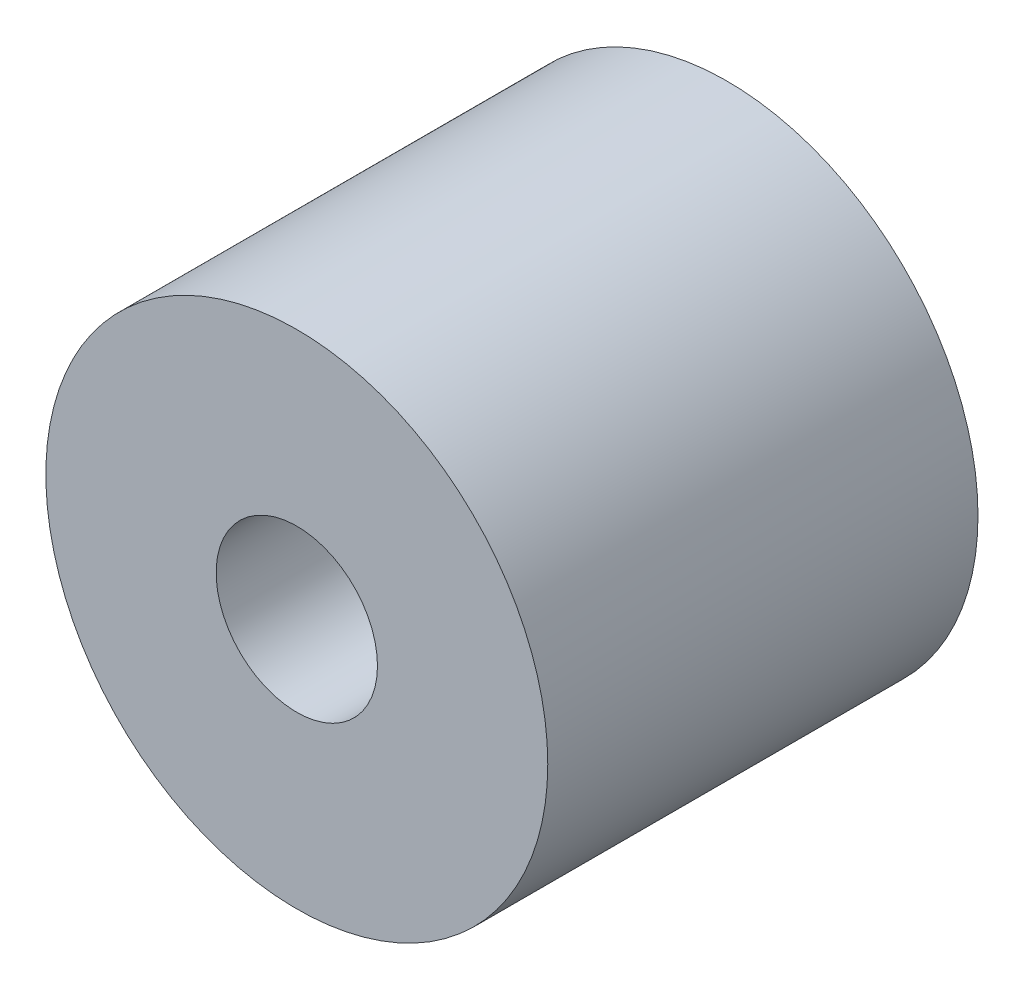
ISO-10303-21;
HEADER;
FILE_DESCRIPTION(('STEP AP214'),'2;1');
FILE_NAME('part.step','',(''),(''),'','','');
FILE_SCHEMA(('AUTOMOTIVE_DESIGN { 1 0 10303 214 1 1 1 1 }'));
ENDSEC;
DATA;
#1=APPLICATION_CONTEXT('core data for automotive mechanical design processes');
#2=APPLICATION_PROTOCOL_DEFINITION('international standard','automotive_design',2000,#1);
#3=PRODUCT_CONTEXT('',#1,'mechanical');
#4=PRODUCT('Part','Part','',(#3));
#5=PRODUCT_RELATED_PRODUCT_CATEGORY('part','',(#4));
#6=PRODUCT_DEFINITION_FORMATION('','',#4);
#7=PRODUCT_DEFINITION_CONTEXT('part definition',#1,'design');
#8=PRODUCT_DEFINITION('design','',#6,#7);
#9=PRODUCT_DEFINITION_SHAPE('','',#8);
#10=(LENGTH_UNIT() NAMED_UNIT(*) SI_UNIT(.MILLI.,.METRE.));
#11=(NAMED_UNIT(*) PLANE_ANGLE_UNIT() SI_UNIT($,.RADIAN.));
#12=(NAMED_UNIT(*) SI_UNIT($,.STERADIAN.) SOLID_ANGLE_UNIT());
#13=UNCERTAINTY_MEASURE_WITH_UNIT(LENGTH_MEASURE(1.E-05),#10,'distance_accuracy_value','');
#14=(GEOMETRIC_REPRESENTATION_CONTEXT(3) GLOBAL_UNCERTAINTY_ASSIGNED_CONTEXT((#13)) GLOBAL_UNIT_ASSIGNED_CONTEXT((#10,
#11,#12)) REPRESENTATION_CONTEXT('',''));
#15=CARTESIAN_POINT('',(0.,0.,0.));
#16=DIRECTION('',(0.,0.,1.));
#17=DIRECTION('',(1.,0.,0.));
#18=AXIS2_PLACEMENT_3D('',#15,#16,#17);
#19=CARTESIAN_POINT('',(0.,0.,12.));
#20=DIRECTION('',(0.,0.,1.));
#21=DIRECTION('',(1.,0.,0.));
#22=AXIS2_PLACEMENT_3D('',#19,#20,#21);
#23=PLANE('',#22);
#24=CARTESIAN_POINT('',(0.,0.,12.));
#25=DIRECTION('',(0.,0.,1.));
#26=DIRECTION('',(1.,0.,0.));
#27=AXIS2_PLACEMENT_3D('',#24,#25,#26);
#28=CIRCLE('',#27,7.);
#29=CARTESIAN_POINT('',(7.,0.,12.));
#30=VERTEX_POINT('',#29);
#31=EDGE_CURVE('E10',#30,#30,#28,.T.);
#32=ORIENTED_EDGE('',*,*,#31,.T.);
#33=EDGE_LOOP('',(#32));
#34=FACE_BOUND('',#33,.T.);
#35=CARTESIAN_POINT('',(0.,0.,12.));
#36=DIRECTION('',(0.,0.,1.));
#37=DIRECTION('',(1.,0.,0.));
#38=AXIS2_PLACEMENT_3D('',#35,#36,#37);
#39=CIRCLE('',#38,2.25);
#40=CARTESIAN_POINT('',(2.25,0.,12.));
#41=VERTEX_POINT('',#40);
#42=EDGE_CURVE('E42',#41,#41,#39,.T.);
#43=ORIENTED_EDGE('',*,*,#42,.F.);
#44=EDGE_LOOP('',(#43));
#45=FACE_BOUND('',#44,.T.);
#46=ADVANCED_FACE('F31',(#34,#45),#23,.T.);
#47=CARTESIAN_POINT('',(0.,0.,0.));
#48=DIRECTION('',(0.,0.,1.));
#49=DIRECTION('',(1.,0.,0.));
#50=AXIS2_PLACEMENT_3D('',#47,#48,#49);
#51=PLANE('',#50);
#52=CARTESIAN_POINT('',(0.,0.,0.));
#53=DIRECTION('',(0.,0.,1.));
#54=DIRECTION('',(1.,0.,0.));
#55=AXIS2_PLACEMENT_3D('',#52,#53,#54);
#56=CIRCLE('',#55,7.);
#57=CARTESIAN_POINT('',(7.,0.,0.));
#58=VERTEX_POINT('',#57);
#59=EDGE_CURVE('E35',#58,#58,#56,.T.);
#60=ORIENTED_EDGE('',*,*,#59,.F.);
#61=EDGE_LOOP('',(#60));
#62=FACE_BOUND('',#61,.T.);
#63=CARTESIAN_POINT('',(0.,0.,0.));
#64=DIRECTION('',(0.,0.,1.));
#65=DIRECTION('',(1.,0.,0.));
#66=AXIS2_PLACEMENT_3D('',#63,#64,#65);
#67=CIRCLE('',#66,2.25);
#68=CARTESIAN_POINT('',(2.25,0.,0.));
#69=VERTEX_POINT('',#68);
#70=EDGE_CURVE('E44',#69,#69,#67,.T.);
#71=ORIENTED_EDGE('',*,*,#70,.T.);
#72=EDGE_LOOP('',(#71));
#73=FACE_BOUND('',#72,.T.);
#74=ADVANCED_FACE('F54',(#62,#73),#51,.F.);
#75=CARTESIAN_POINT('',(0.,0.,12.));
#76=DIRECTION('',(0.,0.,-1.));
#77=DIRECTION('',(-1.,0.,0.));
#78=AXIS2_PLACEMENT_3D('',#75,#76,#77);
#79=CYLINDRICAL_SURFACE('',#78,7.);
#80=ORIENTED_EDGE('',*,*,#31,.F.);
#81=EDGE_LOOP('',(#80));
#82=FACE_BOUND('',#81,.T.);
#83=ORIENTED_EDGE('',*,*,#59,.T.);
#84=EDGE_LOOP('',(#83));
#85=FACE_BOUND('',#84,.T.);
#86=ADVANCED_FACE('F33',(#82,#85),#79,.T.);
#87=CARTESIAN_POINT('',(0.,0.,12.));
#88=DIRECTION('',(0.,0.,-1.));
#89=DIRECTION('',(-1.,0.,0.));
#90=AXIS2_PLACEMENT_3D('',#87,#88,#89);
#91=CYLINDRICAL_SURFACE('',#90,2.25);
#92=ORIENTED_EDGE('',*,*,#42,.T.);
#93=EDGE_LOOP('',(#92));
#94=FACE_BOUND('',#93,.T.);
#95=ORIENTED_EDGE('',*,*,#70,.F.);
#96=EDGE_LOOP('',(#95));
#97=FACE_BOUND('',#96,.T.);
#98=ADVANCED_FACE('F50',(#94,#97),#91,.F.);
#99=CLOSED_SHELL('',(#46,#74,#86,#98));
#100=MANIFOLD_SOLID_BREP('B2',#99);
#101=ADVANCED_BREP_SHAPE_REPRESENTATION('',(#18,#100),#14);
#102=SHAPE_DEFINITION_REPRESENTATION(#9,#101);
ENDSEC;
END-ISO-10303-21;
